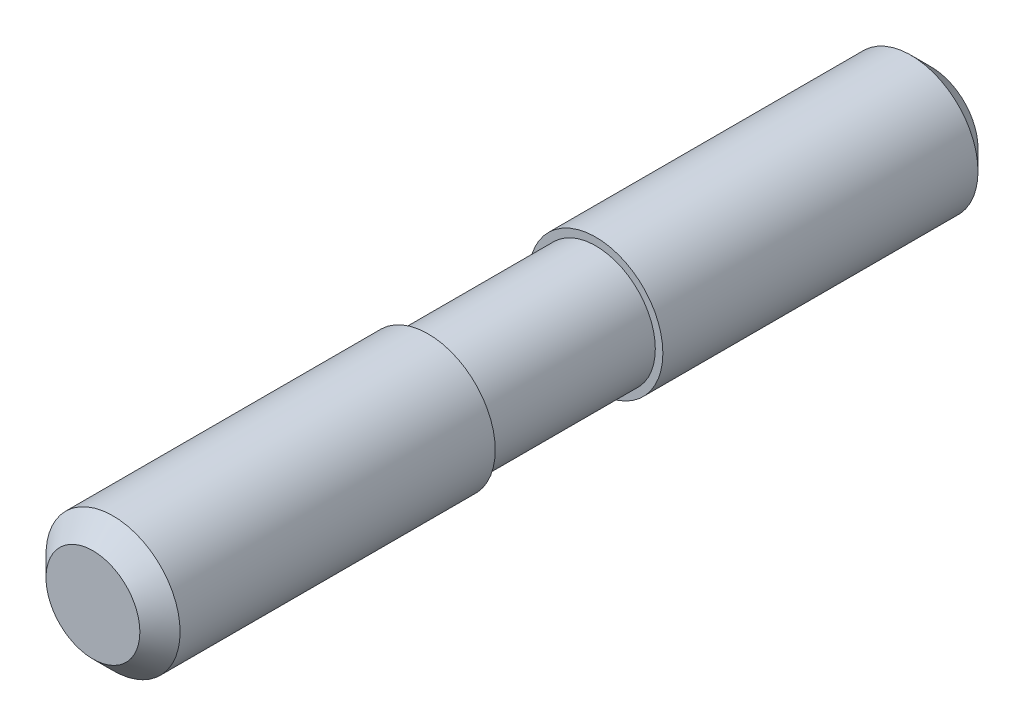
ISO-10303-21;
HEADER;
FILE_DESCRIPTION(('STEP AP214'),'2;1');
FILE_NAME('part.step','',(''),(''),'','','');
FILE_SCHEMA(('AUTOMOTIVE_DESIGN { 1 0 10303 214 1 1 1 1 }'));
ENDSEC;
DATA;
#1=APPLICATION_CONTEXT('core data for automotive mechanical design processes');
#2=APPLICATION_PROTOCOL_DEFINITION('international standard','automotive_design',2000,#1);
#3=PRODUCT_CONTEXT('',#1,'mechanical');
#4=PRODUCT('Part','Part','',(#3));
#5=PRODUCT_RELATED_PRODUCT_CATEGORY('part','',(#4));
#6=PRODUCT_DEFINITION_FORMATION('','',#4);
#7=PRODUCT_DEFINITION_CONTEXT('part definition',#1,'design');
#8=PRODUCT_DEFINITION('design','',#6,#7);
#9=PRODUCT_DEFINITION_SHAPE('','',#8);
#10=(LENGTH_UNIT() NAMED_UNIT(*) SI_UNIT(.MILLI.,.METRE.));
#11=(NAMED_UNIT(*) PLANE_ANGLE_UNIT() SI_UNIT($,.RADIAN.));
#12=(NAMED_UNIT(*) SI_UNIT($,.STERADIAN.) SOLID_ANGLE_UNIT());
#13=UNCERTAINTY_MEASURE_WITH_UNIT(LENGTH_MEASURE(1.E-05),#10,'distance_accuracy_value','');
#14=(GEOMETRIC_REPRESENTATION_CONTEXT(3) GLOBAL_UNCERTAINTY_ASSIGNED_CONTEXT((#13)) GLOBAL_UNIT_ASSIGNED_CONTEXT((#10,
#11,#12)) REPRESENTATION_CONTEXT('',''));
#15=CARTESIAN_POINT('',(0.,0.,0.));
#16=DIRECTION('',(0.,0.,1.));
#17=DIRECTION('',(1.,0.,0.));
#18=AXIS2_PLACEMENT_3D('',#15,#16,#17);
#19=CARTESIAN_POINT('',(0.,0.,0.));
#20=DIRECTION('',(0.,0.,1.));
#21=DIRECTION('',(1.,0.,0.));
#22=AXIS2_PLACEMENT_3D('',#19,#20,#21);
#23=PLANE('',#22);
#24=CARTESIAN_POINT('',(0.,0.,0.));
#25=DIRECTION('',(0.,0.,1.));
#26=DIRECTION('',(1.,0.,0.));
#27=AXIS2_PLACEMENT_3D('',#24,#25,#26);
#28=CIRCLE('',#27,2.8);
#29=CARTESIAN_POINT('',(2.8,0.,0.));
#30=VERTEX_POINT('',#29);
#31=EDGE_CURVE('E8',#30,#30,#28,.T.);
#32=ORIENTED_EDGE('',*,*,#31,.F.);
#33=EDGE_LOOP('',(#32));
#34=FACE_BOUND('',#33,.T.);
#35=ADVANCED_FACE('F12',(#34),#23,.F.);
#36=CARTESIAN_POINT('',(0.,0.,1.2));
#37=DIRECTION('',(0.,0.,1.));
#38=DIRECTION('',(1.,0.,0.));
#39=AXIS2_PLACEMENT_3D('',#36,#37,#38);
#40=CONICAL_SURFACE('',#39,4.,0.785398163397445);
#41=ORIENTED_EDGE('',*,*,#31,.T.);
#42=EDGE_LOOP('',(#41));
#43=FACE_BOUND('',#42,.T.);
#44=CARTESIAN_POINT('',(0.,0.,1.2));
#45=DIRECTION('',(0.,0.,1.));
#46=DIRECTION('',(1.,0.,0.));
#47=AXIS2_PLACEMENT_3D('',#44,#45,#46);
#48=CIRCLE('',#47,4.);
#49=CARTESIAN_POINT('',(4.,0.,1.2));
#50=VERTEX_POINT('',#49);
#51=EDGE_CURVE('E18',#50,#50,#48,.T.);
#52=ORIENTED_EDGE('',*,*,#51,.F.);
#53=EDGE_LOOP('',(#52));
#54=FACE_BOUND('',#53,.T.);
#55=ADVANCED_FACE('F61',(#43,#54),#40,.T.);
#56=CARTESIAN_POINT('',(0.,0.,70.));
#57=DIRECTION('',(0.,0.,1.));
#58=DIRECTION('',(1.,0.,0.));
#59=AXIS2_PLACEMENT_3D('',#56,#57,#58);
#60=CYLINDRICAL_SURFACE('',#59,4.);
#61=CARTESIAN_POINT('',(0.,0.,20.));
#62=DIRECTION('',(0.,0.,1.));
#63=DIRECTION('',(1.,0.,0.));
#64=AXIS2_PLACEMENT_3D('',#61,#62,#63);
#65=CIRCLE('',#64,4.);
#66=CARTESIAN_POINT('',(4.,0.,20.));
#67=VERTEX_POINT('',#66);
#68=EDGE_CURVE('E22',#67,#67,#65,.T.);
#69=ORIENTED_EDGE('',*,*,#68,.F.);
#70=EDGE_LOOP('',(#69));
#71=FACE_BOUND('',#70,.T.);
#72=ORIENTED_EDGE('',*,*,#51,.T.);
#73=EDGE_LOOP('',(#72));
#74=FACE_BOUND('',#73,.T.);
#75=ADVANCED_FACE('F66',(#71,#74),#60,.T.);
#76=CARTESIAN_POINT('',(4.,0.,20.));
#77=DIRECTION('',(0.,0.,-1.));
#78=DIRECTION('',(-1.,0.,0.));
#79=AXIS2_PLACEMENT_3D('',#76,#77,#78);
#80=PLANE('',#79);
#81=CARTESIAN_POINT('',(0.,0.,20.));
#82=DIRECTION('',(0.,0.,1.));
#83=DIRECTION('',(1.,0.,0.));
#84=AXIS2_PLACEMENT_3D('',#81,#82,#83);
#85=CIRCLE('',#84,3.55);
#86=CARTESIAN_POINT('',(3.55,0.,20.));
#87=VERTEX_POINT('',#86);
#88=EDGE_CURVE('E26',#87,#87,#85,.T.);
#89=ORIENTED_EDGE('',*,*,#88,.F.);
#90=EDGE_LOOP('',(#89));
#91=FACE_BOUND('',#90,.T.);
#92=ORIENTED_EDGE('',*,*,#68,.T.);
#93=EDGE_LOOP('',(#92));
#94=FACE_BOUND('',#93,.T.);
#95=ADVANCED_FACE('F70',(#91,#94),#80,.F.);
#96=CARTESIAN_POINT('',(0.,0.,70.));
#97=DIRECTION('',(0.,0.,1.));
#98=DIRECTION('',(1.,0.,0.));
#99=AXIS2_PLACEMENT_3D('',#96,#97,#98);
#100=CYLINDRICAL_SURFACE('',#99,3.55);
#101=CARTESIAN_POINT('',(0.,0.,30.));
#102=DIRECTION('',(0.,0.,1.));
#103=DIRECTION('',(1.,0.,0.));
#104=AXIS2_PLACEMENT_3D('',#101,#102,#103);
#105=CIRCLE('',#104,3.55);
#106=CARTESIAN_POINT('',(3.55,0.,30.));
#107=VERTEX_POINT('',#106);
#108=EDGE_CURVE('E31',#107,#107,#105,.T.);
#109=ORIENTED_EDGE('',*,*,#108,.F.);
#110=EDGE_LOOP('',(#109));
#111=FACE_BOUND('',#110,.T.);
#112=ORIENTED_EDGE('',*,*,#88,.T.);
#113=EDGE_LOOP('',(#112));
#114=FACE_BOUND('',#113,.T.);
#115=ADVANCED_FACE('F77',(#111,#114),#100,.T.);
#116=CARTESIAN_POINT('',(3.55,0.,30.));
#117=DIRECTION('',(0.,0.,1.));
#118=DIRECTION('',(1.,0.,0.));
#119=AXIS2_PLACEMENT_3D('',#116,#117,#118);
#120=PLANE('',#119);
#121=CARTESIAN_POINT('',(0.,0.,30.));
#122=DIRECTION('',(0.,0.,1.));
#123=DIRECTION('',(1.,0.,0.));
#124=AXIS2_PLACEMENT_3D('',#121,#122,#123);
#125=CIRCLE('',#124,4.);
#126=CARTESIAN_POINT('',(4.,0.,30.));
#127=VERTEX_POINT('',#126);
#128=EDGE_CURVE('E34',#127,#127,#125,.T.);
#129=ORIENTED_EDGE('',*,*,#128,.F.);
#130=EDGE_LOOP('',(#129));
#131=FACE_BOUND('',#130,.T.);
#132=ORIENTED_EDGE('',*,*,#108,.T.);
#133=EDGE_LOOP('',(#132));
#134=FACE_BOUND('',#133,.T.);
#135=ADVANCED_FACE('F57',(#131,#134),#120,.F.);
#136=CARTESIAN_POINT('',(0.,0.,70.));
#137=DIRECTION('',(0.,0.,1.));
#138=DIRECTION('',(1.,0.,0.));
#139=AXIS2_PLACEMENT_3D('',#136,#137,#138);
#140=CYLINDRICAL_SURFACE('',#139,4.);
#141=CARTESIAN_POINT('',(0.,0.,48.8));
#142=DIRECTION('',(0.,0.,1.));
#143=DIRECTION('',(1.,0.,0.));
#144=AXIS2_PLACEMENT_3D('',#141,#142,#143);
#145=CIRCLE('',#144,4.);
#146=CARTESIAN_POINT('',(4.,0.,48.8));
#147=VERTEX_POINT('',#146);
#148=EDGE_CURVE('E37',#147,#147,#145,.T.);
#149=ORIENTED_EDGE('',*,*,#148,.F.);
#150=EDGE_LOOP('',(#149));
#151=FACE_BOUND('',#150,.T.);
#152=ORIENTED_EDGE('',*,*,#128,.T.);
#153=EDGE_LOOP('',(#152));
#154=FACE_BOUND('',#153,.T.);
#155=ADVANCED_FACE('F48',(#151,#154),#140,.T.);
#156=CARTESIAN_POINT('',(0.,0.,50.));
#157=DIRECTION('',(0.,0.,-1.));
#158=DIRECTION('',(-1.,0.,0.));
#159=AXIS2_PLACEMENT_3D('',#156,#157,#158);
#160=CONICAL_SURFACE('',#159,2.8,0.785398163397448);
#161=ORIENTED_EDGE('',*,*,#148,.T.);
#162=EDGE_LOOP('',(#161));
#163=FACE_BOUND('',#162,.T.);
#164=CARTESIAN_POINT('',(0.,0.,50.));
#165=DIRECTION('',(0.,0.,1.));
#166=DIRECTION('',(1.,0.,0.));
#167=AXIS2_PLACEMENT_3D('',#164,#165,#166);
#168=CIRCLE('',#167,2.8);
#169=CARTESIAN_POINT('',(2.8,0.,50.));
#170=VERTEX_POINT('',#169);
#171=EDGE_CURVE('E40',#170,#170,#168,.T.);
#172=ORIENTED_EDGE('',*,*,#171,.F.);
#173=EDGE_LOOP('',(#172));
#174=FACE_BOUND('',#173,.T.);
#175=ADVANCED_FACE('F46',(#163,#174),#160,.T.);
#176=CARTESIAN_POINT('',(2.8,0.,50.));
#177=DIRECTION('',(0.,0.,-1.));
#178=DIRECTION('',(-1.,0.,0.));
#179=AXIS2_PLACEMENT_3D('',#176,#177,#178);
#180=PLANE('',#179);
#181=ORIENTED_EDGE('',*,*,#171,.T.);
#182=EDGE_LOOP('',(#181));
#183=FACE_BOUND('',#182,.T.);
#184=ADVANCED_FACE('F44',(#183),#180,.F.);
#185=CLOSED_SHELL('',(#35,#55,#75,#95,#115,#135,#155,#175,#184));
#186=MANIFOLD_SOLID_BREP('B1',#185);
#187=ADVANCED_BREP_SHAPE_REPRESENTATION('',(#18,#186),#14);
#188=SHAPE_DEFINITION_REPRESENTATION(#9,#187);
ENDSEC;
END-ISO-10303-21;
